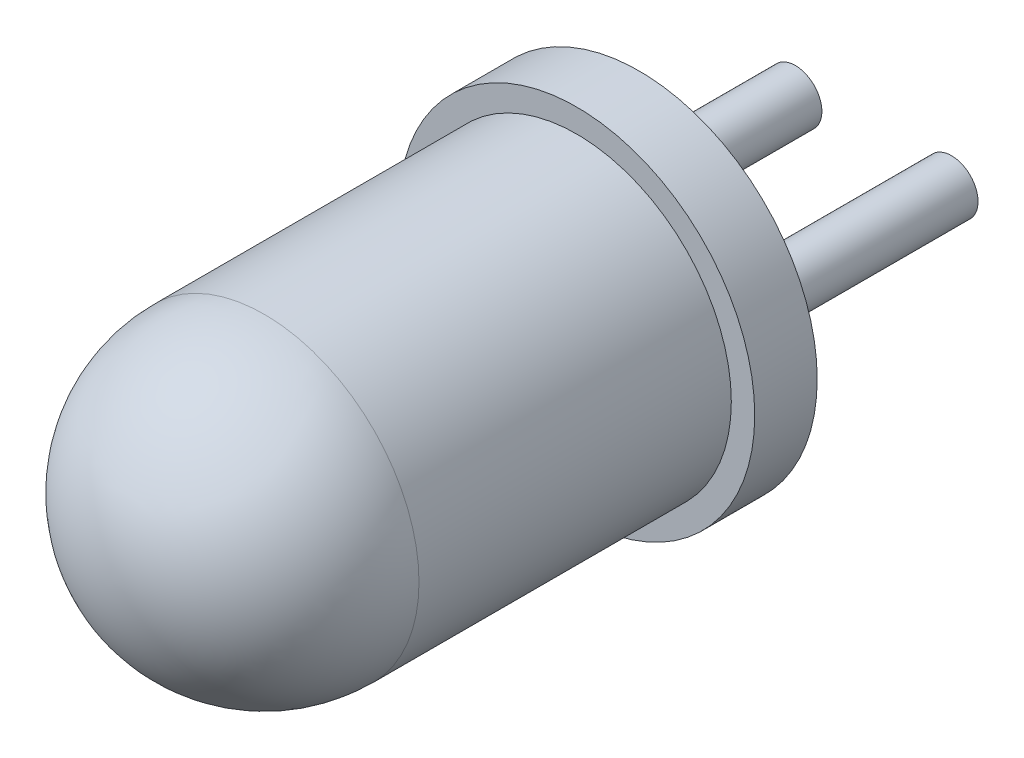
ISO-10303-21;
HEADER;
FILE_DESCRIPTION(('STEP AP214'),'2;1');
FILE_NAME('part.step','',(''),(''),'','','');
FILE_SCHEMA(('AUTOMOTIVE_DESIGN { 1 0 10303 214 1 1 1 1 }'));
ENDSEC;
DATA;
#1=APPLICATION_CONTEXT('core data for automotive mechanical design processes');
#2=APPLICATION_PROTOCOL_DEFINITION('international standard','automotive_design',2000,#1);
#3=PRODUCT_CONTEXT('',#1,'mechanical');
#4=PRODUCT('Part','Part','',(#3));
#5=PRODUCT_RELATED_PRODUCT_CATEGORY('part','',(#4));
#6=PRODUCT_DEFINITION_FORMATION('','',#4);
#7=PRODUCT_DEFINITION_CONTEXT('part definition',#1,'design');
#8=PRODUCT_DEFINITION('design','',#6,#7);
#9=PRODUCT_DEFINITION_SHAPE('','',#8);
#10=(LENGTH_UNIT() NAMED_UNIT(*) SI_UNIT(.MILLI.,.METRE.));
#11=(NAMED_UNIT(*) PLANE_ANGLE_UNIT() SI_UNIT($,.RADIAN.));
#12=(NAMED_UNIT(*) SI_UNIT($,.STERADIAN.) SOLID_ANGLE_UNIT());
#13=UNCERTAINTY_MEASURE_WITH_UNIT(LENGTH_MEASURE(1.E-05),#10,'distance_accuracy_value','');
#14=(GEOMETRIC_REPRESENTATION_CONTEXT(3) GLOBAL_UNCERTAINTY_ASSIGNED_CONTEXT((#13)) GLOBAL_UNIT_ASSIGNED_CONTEXT((#10,
#11,#12)) REPRESENTATION_CONTEXT('',''));
#15=CARTESIAN_POINT('',(0.,0.,0.));
#16=DIRECTION('',(0.,0.,1.));
#17=DIRECTION('',(1.,0.,0.));
#18=AXIS2_PLACEMENT_3D('',#15,#16,#17);
#19=CARTESIAN_POINT('',(1.27,0.,-3.81));
#20=DIRECTION('',(0.,0.,1.));
#21=DIRECTION('',(1.,0.,0.));
#22=AXIS2_PLACEMENT_3D('',#19,#20,#21);
#23=CYLINDRICAL_SURFACE('',#22,0.4318);
#24=CARTESIAN_POINT('',(1.27,0.,-3.81));
#25=DIRECTION('',(0.,0.,-1.));
#26=DIRECTION('',(-1.,0.,0.));
#27=AXIS2_PLACEMENT_3D('',#24,#25,#26);
#28=CIRCLE('',#27,0.4318);
#29=CARTESIAN_POINT('',(0.8382,0.,-3.81));
#30=VERTEX_POINT('',#29);
#31=EDGE_CURVE('E11',#30,#30,#28,.T.);
#32=ORIENTED_EDGE('',*,*,#31,.F.);
#33=EDGE_LOOP('',(#32));
#34=FACE_BOUND('',#33,.T.);
#35=CARTESIAN_POINT('',(1.27,0.,0.));
#36=DIRECTION('',(0.,0.,-1.));
#37=DIRECTION('',(-1.,0.,0.));
#38=AXIS2_PLACEMENT_3D('',#35,#36,#37);
#39=CIRCLE('',#38,0.4318);
#40=CARTESIAN_POINT('',(0.8382,0.,0.));
#41=VERTEX_POINT('',#40);
#42=EDGE_CURVE('E43',#41,#41,#39,.T.);
#43=ORIENTED_EDGE('',*,*,#42,.T.);
#44=EDGE_LOOP('',(#43));
#45=FACE_BOUND('',#44,.T.);
#46=ADVANCED_FACE('F40',(#34,#45),#23,.T.);
#47=CARTESIAN_POINT('',(1.27,0.,-3.81));
#48=DIRECTION('',(0.,0.,-1.));
#49=DIRECTION('',(-1.,0.,0.));
#50=AXIS2_PLACEMENT_3D('',#47,#48,#49);
#51=PLANE('',#50);
#52=ORIENTED_EDGE('',*,*,#31,.T.);
#53=EDGE_LOOP('',(#52));
#54=FACE_BOUND('',#53,.T.);
#55=ADVANCED_FACE('F55',(#54),#51,.T.);
#56=CARTESIAN_POINT('',(1.27,0.,0.));
#57=DIRECTION('',(0.,0.,-1.));
#58=DIRECTION('',(-1.,0.,0.));
#59=AXIS2_PLACEMENT_3D('',#56,#57,#58);
#60=PLANE('',#59);
#61=ORIENTED_EDGE('',*,*,#42,.F.);
#62=EDGE_LOOP('',(#61));
#63=FACE_BOUND('',#62,.T.);
#64=ADVANCED_FACE('F53',(#63),#60,.F.);
#65=CLOSED_SHELL('',(#46,#55,#64));
#66=MANIFOLD_SOLID_BREP('B2',#65);
#67=CARTESIAN_POINT('',(-1.27,0.,-3.81));
#68=DIRECTION('',(0.,0.,1.));
#69=DIRECTION('',(1.,0.,0.));
#70=AXIS2_PLACEMENT_3D('',#67,#68,#69);
#71=CYLINDRICAL_SURFACE('',#70,0.4318);
#72=CARTESIAN_POINT('',(-1.27,0.,-3.81));
#73=DIRECTION('',(0.,0.,-1.));
#74=DIRECTION('',(-1.,0.,0.));
#75=AXIS2_PLACEMENT_3D('',#72,#73,#74);
#76=CIRCLE('',#75,0.4318);
#77=CARTESIAN_POINT('',(-1.7018,0.,-3.81));
#78=VERTEX_POINT('',#77);
#79=EDGE_CURVE('E39',#78,#78,#76,.T.);
#80=ORIENTED_EDGE('',*,*,#79,.F.);
#81=EDGE_LOOP('',(#80));
#82=FACE_BOUND('',#81,.T.);
#83=CARTESIAN_POINT('',(-1.27,0.,0.));
#84=DIRECTION('',(0.,0.,-1.));
#85=DIRECTION('',(-1.,0.,0.));
#86=AXIS2_PLACEMENT_3D('',#83,#84,#85);
#87=CIRCLE('',#86,0.4318);
#88=CARTESIAN_POINT('',(-1.7018,0.,0.));
#89=VERTEX_POINT('',#88);
#90=EDGE_CURVE('E91',#89,#89,#87,.T.);
#91=ORIENTED_EDGE('',*,*,#90,.T.);
#92=EDGE_LOOP('',(#91));
#93=FACE_BOUND('',#92,.T.);
#94=ADVANCED_FACE('F88',(#82,#93),#71,.T.);
#95=CARTESIAN_POINT('',(-1.27,0.,-3.81));
#96=DIRECTION('',(0.,0.,-1.));
#97=DIRECTION('',(-1.,0.,0.));
#98=AXIS2_PLACEMENT_3D('',#95,#96,#97);
#99=PLANE('',#98);
#100=ORIENTED_EDGE('',*,*,#79,.T.);
#101=EDGE_LOOP('',(#100));
#102=FACE_BOUND('',#101,.T.);
#103=ADVANCED_FACE('F103',(#102),#99,.T.);
#104=CARTESIAN_POINT('',(-1.27,0.,0.));
#105=DIRECTION('',(0.,0.,-1.));
#106=DIRECTION('',(-1.,0.,0.));
#107=AXIS2_PLACEMENT_3D('',#104,#105,#106);
#108=PLANE('',#107);
#109=ORIENTED_EDGE('',*,*,#90,.F.);
#110=EDGE_LOOP('',(#109));
#111=FACE_BOUND('',#110,.T.);
#112=ADVANCED_FACE('F101',(#111),#108,.F.);
#113=CLOSED_SHELL('',(#94,#103,#112));
#114=MANIFOLD_SOLID_BREP('B6',#113);
#115=CARTESIAN_POINT('',(0.,0.,1.016));
#116=DIRECTION('',(0.,0.,1.));
#117=DIRECTION('',(1.,0.,0.));
#118=AXIS2_PLACEMENT_3D('',#115,#116,#117);
#119=PLANE('',#118);
#120=CARTESIAN_POINT('',(0.,0.,1.016));
#121=DIRECTION('',(0.,0.,1.));
#122=DIRECTION('',(1.,0.,0.));
#123=AXIS2_PLACEMENT_3D('',#120,#121,#122);
#124=CIRCLE('',#123,2.8956);
#125=CARTESIAN_POINT('',(2.8956,0.,1.016));
#126=VERTEX_POINT('',#125);
#127=EDGE_CURVE('E87',#126,#126,#124,.T.);
#128=ORIENTED_EDGE('',*,*,#127,.T.);
#129=EDGE_LOOP('',(#128));
#130=FACE_BOUND('',#129,.T.);
#131=CARTESIAN_POINT('',(0.,0.,1.016));
#132=DIRECTION('',(0.,0.,1.));
#133=DIRECTION('',(1.,0.,0.));
#134=AXIS2_PLACEMENT_3D('',#131,#132,#133);
#135=CIRCLE('',#134,2.5146);
#136=CARTESIAN_POINT('',(2.5146,0.,1.016));
#137=VERTEX_POINT('',#136);
#138=EDGE_CURVE('E142',#137,#137,#135,.T.);
#139=ORIENTED_EDGE('',*,*,#138,.F.);
#140=EDGE_LOOP('',(#139));
#141=FACE_BOUND('',#140,.T.);
#142=ADVANCED_FACE('F128',(#130,#141),#119,.T.);
#143=CARTESIAN_POINT('',(0.,0.,1.016));
#144=DIRECTION('',(0.,0.,-1.));
#145=DIRECTION('',(-1.,0.,0.));
#146=AXIS2_PLACEMENT_3D('',#143,#144,#145);
#147=CYLINDRICAL_SURFACE('',#146,2.8956);
#148=ORIENTED_EDGE('',*,*,#127,.F.);
#149=EDGE_LOOP('',(#148));
#150=FACE_BOUND('',#149,.T.);
#151=CARTESIAN_POINT('',(0.,0.,0.));
#152=DIRECTION('',(0.,0.,1.));
#153=DIRECTION('',(1.,0.,0.));
#154=AXIS2_PLACEMENT_3D('',#151,#152,#153);
#155=CIRCLE('',#154,2.8956);
#156=CARTESIAN_POINT('',(2.8956,0.,0.));
#157=VERTEX_POINT('',#156);
#158=EDGE_CURVE('E136',#157,#157,#155,.T.);
#159=ORIENTED_EDGE('',*,*,#158,.T.);
#160=EDGE_LOOP('',(#159));
#161=FACE_BOUND('',#160,.T.);
#162=ADVANCED_FACE('F158',(#150,#161),#147,.T.);
#163=CARTESIAN_POINT('',(0.,0.,0.));
#164=DIRECTION('',(0.,0.,1.));
#165=DIRECTION('',(1.,0.,0.));
#166=AXIS2_PLACEMENT_3D('',#163,#164,#165);
#167=PLANE('',#166);
#168=ORIENTED_EDGE('',*,*,#158,.F.);
#169=EDGE_LOOP('',(#168));
#170=FACE_BOUND('',#169,.T.);
#171=ADVANCED_FACE('F152',(#170),#167,.F.);
#172=CARTESIAN_POINT('',(0.,0.,6.096));
#173=DIRECTION('',(0.,0.,-1.));
#174=DIRECTION('',(-1.,0.,0.));
#175=AXIS2_PLACEMENT_3D('',#172,#173,#174);
#176=CYLINDRICAL_SURFACE('',#175,2.5146);
#177=CARTESIAN_POINT('',(0.,0.,6.096));
#178=DIRECTION('',(0.,0.,1.));
#179=DIRECTION('',(1.,0.,0.));
#180=AXIS2_PLACEMENT_3D('',#177,#178,#179);
#181=CIRCLE('',#180,2.5146);
#182=CARTESIAN_POINT('',(2.5146,0.,6.096));
#183=VERTEX_POINT('',#182);
#184=EDGE_CURVE('E132',#183,#183,#181,.T.);
#185=ORIENTED_EDGE('',*,*,#184,.F.);
#186=EDGE_LOOP('',(#185));
#187=FACE_BOUND('',#186,.T.);
#188=ORIENTED_EDGE('',*,*,#138,.T.);
#189=EDGE_LOOP('',(#188));
#190=FACE_BOUND('',#189,.T.);
#191=ADVANCED_FACE('F150',(#187,#190),#176,.T.);
#192=CARTESIAN_POINT('',(0.,0.,6.096));
#193=DIRECTION('',(0.,0.,1.));
#194=DIRECTION('',(1.,0.,0.));
#195=AXIS2_PLACEMENT_3D('',#192,#193,#194);
#196=SPHERICAL_SURFACE('',#195,2.5146);
#197=ORIENTED_EDGE('',*,*,#184,.T.);
#198=EDGE_LOOP('',(#197));
#199=FACE_BOUND('',#198,.T.);
#200=ADVANCED_FACE('F130',(#199),#196,.T.);
#201=CLOSED_SHELL('',(#142,#162,#171,#191,#200));
#202=MANIFOLD_SOLID_BREP('B34',#201);
#203=ADVANCED_BREP_SHAPE_REPRESENTATION('',(#18,#66,#114,#202),#14);
#204=SHAPE_DEFINITION_REPRESENTATION(#9,#203);
ENDSEC;
END-ISO-10303-21;
